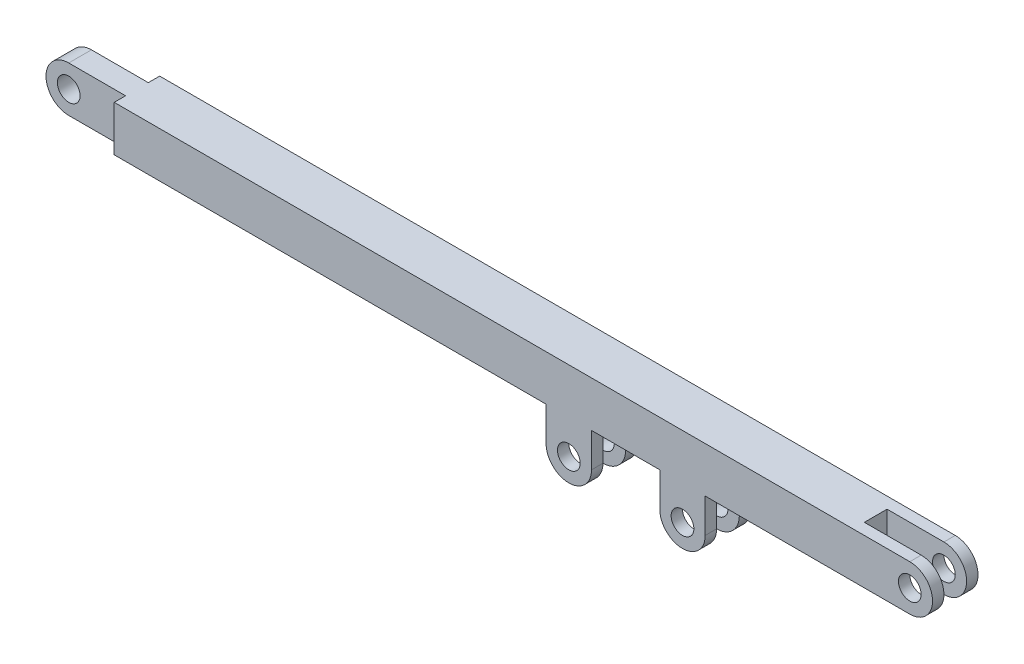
ISO-10303-21;
HEADER;
FILE_DESCRIPTION(('STEP AP214'),'2;1');
FILE_NAME('part.step','',(''),(''),'','','');
FILE_SCHEMA(('AUTOMOTIVE_DESIGN { 1 0 10303 214 1 1 1 1 }'));
ENDSEC;
DATA;
#1=APPLICATION_CONTEXT('core data for automotive mechanical design processes');
#2=APPLICATION_PROTOCOL_DEFINITION('international standard','automotive_design',2000,#1);
#3=PRODUCT_CONTEXT('',#1,'mechanical');
#4=PRODUCT('Part','Part','',(#3));
#5=PRODUCT_RELATED_PRODUCT_CATEGORY('part','',(#4));
#6=PRODUCT_DEFINITION_FORMATION('','',#4);
#7=PRODUCT_DEFINITION_CONTEXT('part definition',#1,'design');
#8=PRODUCT_DEFINITION('design','',#6,#7);
#9=PRODUCT_DEFINITION_SHAPE('','',#8);
#10=(LENGTH_UNIT() NAMED_UNIT(*) SI_UNIT(.MILLI.,.METRE.));
#11=(NAMED_UNIT(*) PLANE_ANGLE_UNIT() SI_UNIT($,.RADIAN.));
#12=(NAMED_UNIT(*) SI_UNIT($,.STERADIAN.) SOLID_ANGLE_UNIT());
#13=UNCERTAINTY_MEASURE_WITH_UNIT(LENGTH_MEASURE(1.E-05),#10,'distance_accuracy_value','');
#14=(GEOMETRIC_REPRESENTATION_CONTEXT(3) GLOBAL_UNCERTAINTY_ASSIGNED_CONTEXT((#13)) GLOBAL_UNIT_ASSIGNED_CONTEXT((#10,
#11,#12)) REPRESENTATION_CONTEXT('',''));
#15=CARTESIAN_POINT('',(0.,0.,0.));
#16=DIRECTION('',(0.,0.,1.));
#17=DIRECTION('',(1.,0.,0.));
#18=AXIS2_PLACEMENT_3D('',#15,#16,#17);
#19=CARTESIAN_POINT('',(860.,-100.,40.));
#20=DIRECTION('',(1.,0.,0.));
#21=DIRECTION('',(0.,0.,-1.));
#22=AXIS2_PLACEMENT_3D('',#19,#20,#21);
#23=PLANE('',#22);
#24=DIRECTION('',(0.,-1.,0.));
#25=VECTOR('',#24,1.);
#26=CARTESIAN_POINT('',(860.,-100.,20.));
#27=LINE('',#26,#25);
#28=CARTESIAN_POINT('',(860.,-40.,20.));
#29=VERTEX_POINT('',#28);
#30=CARTESIAN_POINT('',(860.,-100.,20.));
#31=VERTEX_POINT('',#30);
#32=EDGE_CURVE('E562',#29,#31,#27,.T.);
#33=ORIENTED_EDGE('',*,*,#32,.T.);
#34=DIRECTION('',(0.,0.,-1.));
#35=VECTOR('',#34,1.);
#36=CARTESIAN_POINT('',(860.,-100.,40.));
#37=LINE('',#36,#35);
#38=CARTESIAN_POINT('',(860.,-100.,40.));
#39=VERTEX_POINT('',#38);
#40=EDGE_CURVE('E241',#39,#31,#37,.T.);
#41=ORIENTED_EDGE('',*,*,#40,.F.);
#42=DIRECTION('',(0.,-1.,0.));
#43=VECTOR('',#42,1.);
#44=CARTESIAN_POINT('',(860.,-100.,40.));
#45=LINE('',#44,#43);
#46=CARTESIAN_POINT('',(860.,-40.,40.));
#47=VERTEX_POINT('',#46);
#48=EDGE_CURVE('E546',#47,#39,#45,.T.);
#49=ORIENTED_EDGE('',*,*,#48,.F.);
#50=DIRECTION('',(0.,0.,-1.));
#51=VECTOR('',#50,1.);
#52=CARTESIAN_POINT('',(860.,-40.,40.));
#53=LINE('',#52,#51);
#54=EDGE_CURVE('E545',#47,#29,#53,.T.);
#55=ORIENTED_EDGE('',*,*,#54,.T.);
#56=EDGE_LOOP('',(#33,#41,#49,#55));
#57=FACE_BOUND('',#56,.T.);
#58=ADVANCED_FACE('F32',(#57),#23,.F.);
#59=CARTESIAN_POINT('',(900.,-100.,40.));
#60=DIRECTION('',(0.,0.,-1.));
#61=DIRECTION('',(-1.,0.,0.));
#62=AXIS2_PLACEMENT_3D('',#59,#60,#61);
#63=CYLINDRICAL_SURFACE('',#62,40.);
#64=CARTESIAN_POINT('',(900.,-100.,20.));
#65=DIRECTION('',(0.,0.,1.));
#66=DIRECTION('',(-1.,0.,0.));
#67=AXIS2_PLACEMENT_3D('',#64,#65,#66);
#68=CIRCLE('',#67,40.);
#69=CARTESIAN_POINT('',(940.,-100.,20.));
#70=VERTEX_POINT('',#69);
#71=EDGE_CURVE('E592',#31,#70,#68,.T.);
#72=ORIENTED_EDGE('',*,*,#71,.T.);
#73=DIRECTION('',(0.,0.,-1.));
#74=VECTOR('',#73,1.);
#75=CARTESIAN_POINT('',(940.,-100.,40.));
#76=LINE('',#75,#74);
#77=CARTESIAN_POINT('',(940.,-100.,40.));
#78=VERTEX_POINT('',#77);
#79=EDGE_CURVE('E242',#78,#70,#76,.T.);
#80=ORIENTED_EDGE('',*,*,#79,.F.);
#81=CARTESIAN_POINT('',(900.,-100.,40.));
#82=DIRECTION('',(0.,0.,1.));
#83=DIRECTION('',(-1.,0.,0.));
#84=AXIS2_PLACEMENT_3D('',#81,#82,#83);
#85=CIRCLE('',#84,40.);
#86=EDGE_CURVE('E550',#39,#78,#85,.T.);
#87=ORIENTED_EDGE('',*,*,#86,.F.);
#88=ORIENTED_EDGE('',*,*,#40,.T.);
#89=EDGE_LOOP('',(#72,#80,#87,#88));
#90=FACE_BOUND('',#89,.T.);
#91=ADVANCED_FACE('F493',(#90),#63,.T.);
#92=CARTESIAN_POINT('',(940.,-40.,40.));
#93=DIRECTION('',(-1.,0.,0.));
#94=DIRECTION('',(0.,-1.,0.));
#95=AXIS2_PLACEMENT_3D('',#92,#93,#94);
#96=PLANE('',#95);
#97=DIRECTION('',(0.,1.,0.));
#98=VECTOR('',#97,1.);
#99=CARTESIAN_POINT('',(940.,-40.,20.));
#100=LINE('',#99,#98);
#101=CARTESIAN_POINT('',(940.,-40.,20.));
#102=VERTEX_POINT('',#101);
#103=EDGE_CURVE('E559',#70,#102,#100,.T.);
#104=ORIENTED_EDGE('',*,*,#103,.T.);
#105=DIRECTION('',(0.,0.,-1.));
#106=VECTOR('',#105,1.);
#107=CARTESIAN_POINT('',(940.,-40.,40.));
#108=LINE('',#107,#106);
#109=CARTESIAN_POINT('',(940.,-40.,40.));
#110=VERTEX_POINT('',#109);
#111=EDGE_CURVE('E54',#110,#102,#108,.T.);
#112=ORIENTED_EDGE('',*,*,#111,.F.);
#113=DIRECTION('',(0.,1.,0.));
#114=VECTOR('',#113,1.);
#115=CARTESIAN_POINT('',(940.,-40.,40.));
#116=LINE('',#115,#114);
#117=EDGE_CURVE('E467',#78,#110,#116,.T.);
#118=ORIENTED_EDGE('',*,*,#117,.F.);
#119=ORIENTED_EDGE('',*,*,#79,.T.);
#120=EDGE_LOOP('',(#104,#112,#118,#119));
#121=FACE_BOUND('',#120,.T.);
#122=ADVANCED_FACE('F499',(#121),#96,.F.);
#123=CARTESIAN_POINT('',(900.,-100.,40.));
#124=DIRECTION('',(0.,0.,-1.));
#125=DIRECTION('',(-1.,0.,0.));
#126=AXIS2_PLACEMENT_3D('',#123,#124,#125);
#127=CYLINDRICAL_SURFACE('',#126,20.);
#128=CARTESIAN_POINT('',(900.,-100.,40.));
#129=DIRECTION('',(0.,0.,1.));
#130=DIRECTION('',(1.,0.,0.));
#131=AXIS2_PLACEMENT_3D('',#128,#129,#130);
#132=CIRCLE('',#131,20.);
#133=CARTESIAN_POINT('',(920.,-100.,40.));
#134=VERTEX_POINT('',#133);
#135=EDGE_CURVE('E582',#134,#134,#132,.T.);
#136=ORIENTED_EDGE('',*,*,#135,.T.);
#137=EDGE_LOOP('',(#136));
#138=FACE_BOUND('',#137,.T.);
#139=CARTESIAN_POINT('',(900.,-100.,20.));
#140=DIRECTION('',(0.,0.,1.));
#141=DIRECTION('',(1.,0.,0.));
#142=AXIS2_PLACEMENT_3D('',#139,#140,#141);
#143=CIRCLE('',#142,20.);
#144=CARTESIAN_POINT('',(920.,-100.,20.));
#145=VERTEX_POINT('',#144);
#146=EDGE_CURVE('E599',#145,#145,#143,.T.);
#147=ORIENTED_EDGE('',*,*,#146,.F.);
#148=EDGE_LOOP('',(#147));
#149=FACE_BOUND('',#148,.T.);
#150=ADVANCED_FACE('F618',(#138,#149),#127,.F.);
#151=CARTESIAN_POINT('',(0.,-40.,20.));
#152=DIRECTION('',(0.,1.,0.));
#153=DIRECTION('',(0.,0.,1.));
#154=AXIS2_PLACEMENT_3D('',#151,#152,#153);
#155=PLANE('',#154);
#156=ORIENTED_EDGE('',*,*,#111,.T.);
#157=DIRECTION('',(-1.,0.,0.));
#158=VECTOR('',#157,1.);
#159=CARTESIAN_POINT('',(860.,-40.,20.));
#160=LINE('',#159,#158);
#161=EDGE_CURVE('E47',#102,#29,#160,.T.);
#162=ORIENTED_EDGE('',*,*,#161,.T.);
#163=ORIENTED_EDGE('',*,*,#54,.F.);
#164=DIRECTION('',(1.,0.,0.));
#165=VECTOR('',#164,1.);
#166=CARTESIAN_POINT('',(100.,-40.0000000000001,40.));
#167=LINE('',#166,#165);
#168=CARTESIAN_POINT('',(100.,-40.0000000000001,40.));
#169=VERTEX_POINT('',#168);
#170=EDGE_CURVE('E363',#169,#47,#167,.T.);
#171=ORIENTED_EDGE('',*,*,#170,.F.);
#172=DIRECTION('',(0.,0.,-1.));
#173=VECTOR('',#172,1.);
#174=CARTESIAN_POINT('',(100.,-40.0000000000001,40.));
#175=LINE('',#174,#173);
#176=CARTESIAN_POINT('',(100.,-40.,20.));
#177=VERTEX_POINT('',#176);
#178=EDGE_CURVE('E380',#169,#177,#175,.T.);
#179=ORIENTED_EDGE('',*,*,#178,.T.);
#180=DIRECTION('',(1.,0.,0.));
#181=VECTOR('',#180,1.);
#182=CARTESIAN_POINT('',(0.,-40.,20.));
#183=LINE('',#182,#181);
#184=CARTESIAN_POINT('',(0.,-40.,20.));
#185=VERTEX_POINT('',#184);
#186=EDGE_CURVE('E401',#185,#177,#183,.T.);
#187=ORIENTED_EDGE('',*,*,#186,.F.);
#188=DIRECTION('',(0.,0.,-1.));
#189=VECTOR('',#188,1.);
#190=CARTESIAN_POINT('',(0.,-40.,20.));
#191=LINE('',#190,#189);
#192=CARTESIAN_POINT('',(0.,-40.,-20.));
#193=VERTEX_POINT('',#192);
#194=EDGE_CURVE('E11',#185,#193,#191,.T.);
#195=ORIENTED_EDGE('',*,*,#194,.T.);
#196=DIRECTION('',(1.,0.,0.));
#197=VECTOR('',#196,1.);
#198=CARTESIAN_POINT('',(0.,-40.,-20.));
#199=LINE('',#198,#197);
#200=CARTESIAN_POINT('',(100.,-40.0000000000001,-20.));
#201=VERTEX_POINT('',#200);
#202=EDGE_CURVE('E409',#193,#201,#199,.T.);
#203=ORIENTED_EDGE('',*,*,#202,.T.);
#204=CARTESIAN_POINT('',(100.,-40.0000000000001,-40.));
#205=VERTEX_POINT('',#204);
#206=EDGE_CURVE('E366',#201,#205,#175,.T.);
#207=ORIENTED_EDGE('',*,*,#206,.T.);
#208=DIRECTION('',(1.,0.,0.));
#209=VECTOR('',#208,1.);
#210=CARTESIAN_POINT('',(100.,-40.0000000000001,-40.));
#211=LINE('',#210,#209);
#212=CARTESIAN_POINT('',(860.,-40.,-40.));
#213=VERTEX_POINT('',#212);
#214=EDGE_CURVE('E358',#205,#213,#211,.T.);
#215=ORIENTED_EDGE('',*,*,#214,.T.);
#216=CARTESIAN_POINT('',(860.,-40.,-20.));
#217=VERTEX_POINT('',#216);
#218=EDGE_CURVE('E556',#217,#213,#53,.T.);
#219=ORIENTED_EDGE('',*,*,#218,.F.);
#220=DIRECTION('',(-1.,0.,0.));
#221=VECTOR('',#220,1.);
#222=CARTESIAN_POINT('',(860.,-40.,-20.));
#223=LINE('',#222,#221);
#224=CARTESIAN_POINT('',(940.,-40.,-20.));
#225=VERTEX_POINT('',#224);
#226=EDGE_CURVE('E223',#225,#217,#223,.T.);
#227=ORIENTED_EDGE('',*,*,#226,.F.);
#228=CARTESIAN_POINT('',(940.,-40.,-40.));
#229=VERTEX_POINT('',#228);
#230=EDGE_CURVE('E543',#225,#229,#108,.T.);
#231=ORIENTED_EDGE('',*,*,#230,.T.);
#232=CARTESIAN_POINT('',(1060.,-40.,-40.));
#233=VERTEX_POINT('',#232);
#234=EDGE_CURVE('E379',#229,#233,#211,.T.);
#235=ORIENTED_EDGE('',*,*,#234,.T.);
#236=DIRECTION('',(0.,0.,-1.));
#237=VECTOR('',#236,1.);
#238=CARTESIAN_POINT('',(1060.,-40.,40.));
#239=LINE('',#238,#237);
#240=CARTESIAN_POINT('',(1060.,-40.,-20.));
#241=VERTEX_POINT('',#240);
#242=EDGE_CURVE('E291',#241,#233,#239,.T.);
#243=ORIENTED_EDGE('',*,*,#242,.F.);
#244=DIRECTION('',(-1.,0.,0.));
#245=VECTOR('',#244,1.);
#246=CARTESIAN_POINT('',(1060.,-40.,-20.));
#247=LINE('',#246,#245);
#248=CARTESIAN_POINT('',(1140.,-40.,-20.));
#249=VERTEX_POINT('',#248);
#250=EDGE_CURVE('E263',#249,#241,#247,.T.);
#251=ORIENTED_EDGE('',*,*,#250,.F.);
#252=DIRECTION('',(0.,0.,-1.));
#253=VECTOR('',#252,1.);
#254=CARTESIAN_POINT('',(1140.,-40.,40.));
#255=LINE('',#254,#253);
#256=CARTESIAN_POINT('',(1140.,-40.,-40.));
#257=VERTEX_POINT('',#256);
#258=EDGE_CURVE('E302',#249,#257,#255,.T.);
#259=ORIENTED_EDGE('',*,*,#258,.T.);
#260=CARTESIAN_POINT('',(1500.,-40.,-40.));
#261=VERTEX_POINT('',#260);
#262=EDGE_CURVE('E376',#257,#261,#211,.T.);
#263=ORIENTED_EDGE('',*,*,#262,.T.);
#264=DIRECTION('',(0.,0.,-1.));
#265=VECTOR('',#264,1.);
#266=CARTESIAN_POINT('',(1500.,-40.,20.));
#267=LINE('',#266,#265);
#268=CARTESIAN_POINT('',(1500.,-40.,-20.));
#269=VERTEX_POINT('',#268);
#270=EDGE_CURVE('E418',#269,#261,#267,.T.);
#271=ORIENTED_EDGE('',*,*,#270,.F.);
#272=DIRECTION('',(1.,0.,0.));
#273=VECTOR('',#272,1.);
#274=CARTESIAN_POINT('',(1400.,-40.,-20.));
#275=LINE('',#274,#273);
#276=CARTESIAN_POINT('',(1400.,-40.,-20.));
#277=VERTEX_POINT('',#276);
#278=EDGE_CURVE('E330',#277,#269,#275,.T.);
#279=ORIENTED_EDGE('',*,*,#278,.F.);
#280=DIRECTION('',(0.,0.,1.));
#281=VECTOR('',#280,1.);
#282=CARTESIAN_POINT('',(1400.,-40.,-20.));
#283=LINE('',#282,#281);
#284=CARTESIAN_POINT('',(1400.,-40.,20.));
#285=VERTEX_POINT('',#284);
#286=EDGE_CURVE('E342',#277,#285,#283,.T.);
#287=ORIENTED_EDGE('',*,*,#286,.T.);
#288=DIRECTION('',(1.,0.,0.));
#289=VECTOR('',#288,1.);
#290=CARTESIAN_POINT('',(1400.,-40.,20.));
#291=LINE('',#290,#289);
#292=CARTESIAN_POINT('',(1500.,-40.,20.));
#293=VERTEX_POINT('',#292);
#294=EDGE_CURVE('E324',#285,#293,#291,.T.);
#295=ORIENTED_EDGE('',*,*,#294,.T.);
#296=CARTESIAN_POINT('',(1500.,-40.,40.));
#297=VERTEX_POINT('',#296);
#298=EDGE_CURVE('E40',#297,#293,#267,.T.);
#299=ORIENTED_EDGE('',*,*,#298,.F.);
#300=CARTESIAN_POINT('',(1140.,-40.,40.));
#301=VERTEX_POINT('',#300);
#302=EDGE_CURVE('E362',#301,#297,#167,.T.);
#303=ORIENTED_EDGE('',*,*,#302,.F.);
#304=CARTESIAN_POINT('',(1140.,-40.,20.));
#305=VERTEX_POINT('',#304);
#306=EDGE_CURVE('E303',#301,#305,#255,.T.);
#307=ORIENTED_EDGE('',*,*,#306,.T.);
#308=DIRECTION('',(-1.,0.,0.));
#309=VECTOR('',#308,1.);
#310=CARTESIAN_POINT('',(1060.,-40.,20.));
#311=LINE('',#310,#309);
#312=CARTESIAN_POINT('',(1060.,-40.,20.));
#313=VERTEX_POINT('',#312);
#314=EDGE_CURVE('E259',#305,#313,#311,.T.);
#315=ORIENTED_EDGE('',*,*,#314,.T.);
#316=CARTESIAN_POINT('',(1060.,-40.,40.));
#317=VERTEX_POINT('',#316);
#318=EDGE_CURVE('E299',#317,#313,#239,.T.);
#319=ORIENTED_EDGE('',*,*,#318,.F.);
#320=EDGE_CURVE('E367',#110,#317,#167,.T.);
#321=ORIENTED_EDGE('',*,*,#320,.F.);
#322=EDGE_LOOP('',(#156,#162,#163,#171,#179,#187,#195,#203,#207,#215,#219,#227,#231,#235,#243,
#251,#259,#263,#271,#279,#287,#295,#299,#303,#307,#315,#319,#321));
#323=FACE_BOUND('',#322,.T.);
#324=ADVANCED_FACE('F448',(#323),#155,.F.);
#325=CARTESIAN_POINT('',(1060.,-100.,40.));
#326=DIRECTION('',(1.,0.,0.));
#327=DIRECTION('',(0.,0.,-1.));
#328=AXIS2_PLACEMENT_3D('',#325,#326,#327);
#329=PLANE('',#328);
#330=DIRECTION('',(0.,-1.,0.));
#331=VECTOR('',#330,1.);
#332=CARTESIAN_POINT('',(1060.,-100.,20.));
#333=LINE('',#332,#331);
#334=CARTESIAN_POINT('',(1060.,-100.,20.));
#335=VERTEX_POINT('',#334);
#336=EDGE_CURVE('E253',#313,#335,#333,.T.);
#337=ORIENTED_EDGE('',*,*,#336,.T.);
#338=DIRECTION('',(0.,0.,-1.));
#339=VECTOR('',#338,1.);
#340=CARTESIAN_POINT('',(1060.,-100.,40.));
#341=LINE('',#340,#339);
#342=CARTESIAN_POINT('',(1060.,-100.,40.));
#343=VERTEX_POINT('',#342);
#344=EDGE_CURVE('E311',#343,#335,#341,.T.);
#345=ORIENTED_EDGE('',*,*,#344,.F.);
#346=DIRECTION('',(0.,-1.,0.));
#347=VECTOR('',#346,1.);
#348=CARTESIAN_POINT('',(1060.,-100.,40.));
#349=LINE('',#348,#347);
#350=EDGE_CURVE('E282',#317,#343,#349,.T.);
#351=ORIENTED_EDGE('',*,*,#350,.F.);
#352=ORIENTED_EDGE('',*,*,#318,.T.);
#353=EDGE_LOOP('',(#337,#345,#351,#352));
#354=FACE_BOUND('',#353,.T.);
#355=ADVANCED_FACE('F470',(#354),#329,.F.);
#356=CARTESIAN_POINT('',(1100.,-100.,40.));
#357=DIRECTION('',(0.,0.,-1.));
#358=DIRECTION('',(-1.,0.,0.));
#359=AXIS2_PLACEMENT_3D('',#356,#357,#358);
#360=CYLINDRICAL_SURFACE('',#359,40.);
#361=CARTESIAN_POINT('',(1100.,-100.,20.));
#362=DIRECTION('',(0.,0.,1.));
#363=DIRECTION('',(-1.,0.,0.));
#364=AXIS2_PLACEMENT_3D('',#361,#362,#363);
#365=CIRCLE('',#364,40.);
#366=CARTESIAN_POINT('',(1140.,-100.,20.));
#367=VERTEX_POINT('',#366);
#368=EDGE_CURVE('E268',#335,#367,#365,.T.);
#369=ORIENTED_EDGE('',*,*,#368,.T.);
#370=DIRECTION('',(0.,0.,-1.));
#371=VECTOR('',#370,1.);
#372=CARTESIAN_POINT('',(1140.,-100.,40.));
#373=LINE('',#372,#371);
#374=CARTESIAN_POINT('',(1140.,-100.,40.));
#375=VERTEX_POINT('',#374);
#376=EDGE_CURVE('E307',#375,#367,#373,.T.);
#377=ORIENTED_EDGE('',*,*,#376,.F.);
#378=CARTESIAN_POINT('',(1100.,-100.,40.));
#379=DIRECTION('',(0.,0.,1.));
#380=DIRECTION('',(-1.,0.,0.));
#381=AXIS2_PLACEMENT_3D('',#378,#379,#380);
#382=CIRCLE('',#381,40.);
#383=EDGE_CURVE('E285',#343,#375,#382,.T.);
#384=ORIENTED_EDGE('',*,*,#383,.F.);
#385=ORIENTED_EDGE('',*,*,#344,.T.);
#386=EDGE_LOOP('',(#369,#377,#384,#385));
#387=FACE_BOUND('',#386,.T.);
#388=ADVANCED_FACE('F477',(#387),#360,.T.);
#389=CARTESIAN_POINT('',(1140.,-40.,40.));
#390=DIRECTION('',(-1.,0.,0.));
#391=DIRECTION('',(0.,-1.,0.));
#392=AXIS2_PLACEMENT_3D('',#389,#390,#391);
#393=PLANE('',#392);
#394=DIRECTION('',(0.,1.,0.));
#395=VECTOR('',#394,1.);
#396=CARTESIAN_POINT('',(1140.,-40.,20.));
#397=LINE('',#396,#395);
#398=EDGE_CURVE('E271',#367,#305,#397,.T.);
#399=ORIENTED_EDGE('',*,*,#398,.T.);
#400=ORIENTED_EDGE('',*,*,#306,.F.);
#401=DIRECTION('',(0.,1.,0.));
#402=VECTOR('',#401,1.);
#403=CARTESIAN_POINT('',(1140.,-40.,40.));
#404=LINE('',#403,#402);
#405=EDGE_CURVE('E288',#375,#301,#404,.T.);
#406=ORIENTED_EDGE('',*,*,#405,.F.);
#407=ORIENTED_EDGE('',*,*,#376,.T.);
#408=EDGE_LOOP('',(#399,#400,#406,#407));
#409=FACE_BOUND('',#408,.T.);
#410=ADVANCED_FACE('F474',(#409),#393,.F.);
#411=CARTESIAN_POINT('',(1100.,-100.,40.));
#412=DIRECTION('',(0.,0.,-1.));
#413=DIRECTION('',(-1.,0.,0.));
#414=AXIS2_PLACEMENT_3D('',#411,#412,#413);
#415=CYLINDRICAL_SURFACE('',#414,20.);
#416=CARTESIAN_POINT('',(1100.,-100.,40.));
#417=DIRECTION('',(0.,0.,1.));
#418=DIRECTION('',(1.,0.,0.));
#419=AXIS2_PLACEMENT_3D('',#416,#417,#418);
#420=CIRCLE('',#419,20.);
#421=CARTESIAN_POINT('',(1120.,-100.,40.));
#422=VERTEX_POINT('',#421);
#423=EDGE_CURVE('E276',#422,#422,#420,.T.);
#424=ORIENTED_EDGE('',*,*,#423,.T.);
#425=EDGE_LOOP('',(#424));
#426=FACE_BOUND('',#425,.T.);
#427=CARTESIAN_POINT('',(1100.,-100.,20.));
#428=DIRECTION('',(0.,0.,1.));
#429=DIRECTION('',(1.,0.,0.));
#430=AXIS2_PLACEMENT_3D('',#427,#428,#429);
#431=CIRCLE('',#430,20.);
#432=CARTESIAN_POINT('',(1120.,-100.,20.));
#433=VERTEX_POINT('',#432);
#434=EDGE_CURVE('E245',#433,#433,#431,.T.);
#435=ORIENTED_EDGE('',*,*,#434,.F.);
#436=EDGE_LOOP('',(#435));
#437=FACE_BOUND('',#436,.T.);
#438=ADVANCED_FACE('F485',(#426,#437),#415,.F.);
#439=CARTESIAN_POINT('',(1500.,0.,20.));
#440=DIRECTION('',(0.,0.,-1.));
#441=DIRECTION('',(-1.,0.,0.));
#442=AXIS2_PLACEMENT_3D('',#439,#440,#441);
#443=CYLINDRICAL_SURFACE('',#442,40.);
#444=CARTESIAN_POINT('',(1500.,0.,-20.));
#445=DIRECTION('',(0.,0.,1.));
#446=DIRECTION('',(1.,0.,0.));
#447=AXIS2_PLACEMENT_3D('',#444,#445,#446);
#448=CIRCLE('',#447,40.);
#449=CARTESIAN_POINT('',(1500.,40.,-20.));
#450=VERTEX_POINT('',#449);
#451=EDGE_CURVE('E321',#269,#450,#448,.T.);
#452=ORIENTED_EDGE('',*,*,#451,.F.);
#453=ORIENTED_EDGE('',*,*,#270,.T.);
#454=CARTESIAN_POINT('',(1500.,0.,-40.));
#455=DIRECTION('',(0.,0.,1.));
#456=DIRECTION('',(1.,0.,0.));
#457=AXIS2_PLACEMENT_3D('',#454,#455,#456);
#458=CIRCLE('',#457,40.);
#459=CARTESIAN_POINT('',(1500.,40.,-40.));
#460=VERTEX_POINT('',#459);
#461=EDGE_CURVE('E351',#261,#460,#458,.T.);
#462=ORIENTED_EDGE('',*,*,#461,.T.);
#463=DIRECTION('',(0.,0.,-1.));
#464=VECTOR('',#463,1.);
#465=CARTESIAN_POINT('',(1500.,40.,20.));
#466=LINE('',#465,#464);
#467=EDGE_CURVE('E415',#450,#460,#466,.T.);
#468=ORIENTED_EDGE('',*,*,#467,.F.);
#469=EDGE_LOOP('',(#452,#453,#462,#468));
#470=FACE_BOUND('',#469,.T.);
#471=ADVANCED_FACE('F428',(#470),#443,.T.);
#472=CARTESIAN_POINT('',(0.,40.,20.));
#473=DIRECTION('',(0.,-1.,0.));
#474=DIRECTION('',(0.,0.,-1.));
#475=AXIS2_PLACEMENT_3D('',#472,#473,#474);
#476=PLANE('',#475);
#477=DIRECTION('',(-1.,0.,0.));
#478=VECTOR('',#477,1.);
#479=CARTESIAN_POINT('',(1400.,40.0000000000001,-20.));
#480=LINE('',#479,#478);
#481=CARTESIAN_POINT('',(1400.,40.0000000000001,-20.));
#482=VERTEX_POINT('',#481);
#483=EDGE_CURVE('E323',#450,#482,#480,.T.);
#484=ORIENTED_EDGE('',*,*,#483,.F.);
#485=ORIENTED_EDGE('',*,*,#467,.T.);
#486=DIRECTION('',(-1.,0.,0.));
#487=VECTOR('',#486,1.);
#488=CARTESIAN_POINT('',(100.,40.,-40.));
#489=LINE('',#488,#487);
#490=CARTESIAN_POINT('',(100.,40.,-40.));
#491=VERTEX_POINT('',#490);
#492=EDGE_CURVE('E370',#460,#491,#489,.T.);
#493=ORIENTED_EDGE('',*,*,#492,.T.);
#494=DIRECTION('',(0.,0.,-1.));
#495=VECTOR('',#494,1.);
#496=CARTESIAN_POINT('',(100.,40.,40.));
#497=LINE('',#496,#495);
#498=CARTESIAN_POINT('',(100.,40.,-20.));
#499=VERTEX_POINT('',#498);
#500=EDGE_CURVE('E383',#499,#491,#497,.T.);
#501=ORIENTED_EDGE('',*,*,#500,.F.);
#502=DIRECTION('',(-1.,0.,0.));
#503=VECTOR('',#502,1.);
#504=CARTESIAN_POINT('',(0.,40.,-20.));
#505=LINE('',#504,#503);
#506=CARTESIAN_POINT('',(0.,40.,-20.));
#507=VERTEX_POINT('',#506);
#508=EDGE_CURVE('E402',#499,#507,#505,.T.);
#509=ORIENTED_EDGE('',*,*,#508,.T.);
#510=DIRECTION('',(0.,0.,-1.));
#511=VECTOR('',#510,1.);
#512=CARTESIAN_POINT('',(0.,40.,20.));
#513=LINE('',#512,#511);
#514=CARTESIAN_POINT('',(0.,40.,20.));
#515=VERTEX_POINT('',#514);
#516=EDGE_CURVE('E406',#515,#507,#513,.T.);
#517=ORIENTED_EDGE('',*,*,#516,.F.);
#518=DIRECTION('',(-1.,0.,0.));
#519=VECTOR('',#518,1.);
#520=CARTESIAN_POINT('',(0.,40.,20.));
#521=LINE('',#520,#519);
#522=CARTESIAN_POINT('',(100.,40.,20.));
#523=VERTEX_POINT('',#522);
#524=EDGE_CURVE('E404',#523,#515,#521,.T.);
#525=ORIENTED_EDGE('',*,*,#524,.F.);
#526=CARTESIAN_POINT('',(100.,40.,40.));
#527=VERTEX_POINT('',#526);
#528=EDGE_CURVE('E384',#527,#523,#497,.T.);
#529=ORIENTED_EDGE('',*,*,#528,.F.);
#530=DIRECTION('',(-1.,0.,0.));
#531=VECTOR('',#530,1.);
#532=CARTESIAN_POINT('',(100.,40.,40.));
#533=LINE('',#532,#531);
#534=CARTESIAN_POINT('',(1500.,40.,40.));
#535=VERTEX_POINT('',#534);
#536=EDGE_CURVE('E357',#535,#527,#533,.T.);
#537=ORIENTED_EDGE('',*,*,#536,.F.);
#538=CARTESIAN_POINT('',(1500.,40.,20.));
#539=VERTEX_POINT('',#538);
#540=EDGE_CURVE('E416',#535,#539,#466,.T.);
#541=ORIENTED_EDGE('',*,*,#540,.T.);
#542=DIRECTION('',(-1.,0.,0.));
#543=VECTOR('',#542,1.);
#544=CARTESIAN_POINT('',(1400.,40.0000000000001,20.));
#545=LINE('',#544,#543);
#546=CARTESIAN_POINT('',(1400.,40.,20.));
#547=VERTEX_POINT('',#546);
#548=EDGE_CURVE('E335',#539,#547,#545,.T.);
#549=ORIENTED_EDGE('',*,*,#548,.T.);
#550=DIRECTION('',(0.,0.,1.));
#551=VECTOR('',#550,1.);
#552=CARTESIAN_POINT('',(1400.,40.0000000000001,-20.));
#553=LINE('',#552,#551);
#554=EDGE_CURVE('E332',#482,#547,#553,.T.);
#555=ORIENTED_EDGE('',*,*,#554,.F.);
#556=EDGE_LOOP('',(#484,#485,#493,#501,#509,#517,#525,#529,#537,#541,#549,#555));
#557=FACE_BOUND('',#556,.T.);
#558=ADVANCED_FACE('F443',(#557),#476,.F.);
#559=CARTESIAN_POINT('',(1500.,0.,20.));
#560=DIRECTION('',(0.,0.,-1.));
#561=DIRECTION('',(-1.,0.,0.));
#562=AXIS2_PLACEMENT_3D('',#559,#560,#561);
#563=CYLINDRICAL_SURFACE('',#562,20.);
#564=CARTESIAN_POINT('',(1500.,0.,-40.));
#565=DIRECTION('',(0.,0.,1.));
#566=DIRECTION('',(1.,0.,0.));
#567=AXIS2_PLACEMENT_3D('',#564,#565,#566);
#568=CIRCLE('',#567,20.);
#569=CARTESIAN_POINT('',(1520.,0.,-40.));
#570=VERTEX_POINT('',#569);
#571=EDGE_CURVE('E345',#570,#570,#568,.T.);
#572=ORIENTED_EDGE('',*,*,#571,.F.);
#573=EDGE_LOOP('',(#572));
#574=FACE_BOUND('',#573,.T.);
#575=CARTESIAN_POINT('',(1500.,0.,-20.));
#576=DIRECTION('',(0.,0.,1.));
#577=DIRECTION('',(1.,0.,0.));
#578=AXIS2_PLACEMENT_3D('',#575,#576,#577);
#579=CIRCLE('',#578,20.);
#580=CARTESIAN_POINT('',(1520.,0.,-20.));
#581=VERTEX_POINT('',#580);
#582=EDGE_CURVE('E315',#581,#581,#579,.T.);
#583=ORIENTED_EDGE('',*,*,#582,.T.);
#584=EDGE_LOOP('',(#583));
#585=FACE_BOUND('',#584,.T.);
#586=ADVANCED_FACE('F640',(#574,#585),#563,.F.);
#587=CARTESIAN_POINT('',(0.,0.,20.));
#588=DIRECTION('',(0.,0.,1.));
#589=DIRECTION('',(1.,0.,0.));
#590=AXIS2_PLACEMENT_3D('',#587,#588,#589);
#591=PLANE('',#590);
#592=CARTESIAN_POINT('',(0.,0.,20.));
#593=DIRECTION('',(0.,0.,1.));
#594=DIRECTION('',(1.,0.,0.));
#595=AXIS2_PLACEMENT_3D('',#592,#593,#594);
#596=CIRCLE('',#595,20.);
#597=CARTESIAN_POINT('',(20.,0.,20.));
#598=VERTEX_POINT('',#597);
#599=EDGE_CURVE('E392',#598,#598,#596,.T.);
#600=ORIENTED_EDGE('',*,*,#599,.F.);
#601=EDGE_LOOP('',(#600));
#602=FACE_BOUND('',#601,.T.);
#603=ORIENTED_EDGE('',*,*,#186,.T.);
#604=DIRECTION('',(0.,1.,0.));
#605=VECTOR('',#604,1.);
#606=CARTESIAN_POINT('',(100.,0.,20.));
#607=LINE('',#606,#605);
#608=EDGE_CURVE('E389',#177,#523,#607,.T.);
#609=ORIENTED_EDGE('',*,*,#608,.T.);
#610=ORIENTED_EDGE('',*,*,#524,.T.);
#611=CARTESIAN_POINT('',(0.,0.,20.));
#612=DIRECTION('',(0.,0.,1.));
#613=DIRECTION('',(1.,0.,0.));
#614=AXIS2_PLACEMENT_3D('',#611,#612,#613);
#615=CIRCLE('',#614,40.);
#616=EDGE_CURVE('E398',#515,#185,#615,.T.);
#617=ORIENTED_EDGE('',*,*,#616,.T.);
#618=EDGE_LOOP('',(#603,#609,#610,#617));
#619=FACE_BOUND('',#618,.T.);
#620=ADVANCED_FACE('F569',(#602,#619),#591,.T.);
#621=CARTESIAN_POINT('',(0.,0.,-20.));
#622=DIRECTION('',(0.,0.,1.));
#623=DIRECTION('',(1.,0.,0.));
#624=AXIS2_PLACEMENT_3D('',#621,#622,#623);
#625=PLANE('',#624);
#626=CARTESIAN_POINT('',(0.,0.,-20.));
#627=DIRECTION('',(0.,0.,1.));
#628=DIRECTION('',(1.,0.,0.));
#629=AXIS2_PLACEMENT_3D('',#626,#627,#628);
#630=CIRCLE('',#629,20.);
#631=CARTESIAN_POINT('',(20.,0.,-20.));
#632=VERTEX_POINT('',#631);
#633=EDGE_CURVE('E391',#632,#632,#630,.T.);
#634=ORIENTED_EDGE('',*,*,#633,.T.);
#635=EDGE_LOOP('',(#634));
#636=FACE_BOUND('',#635,.T.);
#637=DIRECTION('',(0.,1.,0.));
#638=VECTOR('',#637,1.);
#639=CARTESIAN_POINT('',(100.,0.,-20.));
#640=LINE('',#639,#638);
#641=EDGE_CURVE('E387',#201,#499,#640,.T.);
#642=ORIENTED_EDGE('',*,*,#641,.F.);
#643=ORIENTED_EDGE('',*,*,#202,.F.);
#644=CARTESIAN_POINT('',(0.,0.,-20.));
#645=DIRECTION('',(0.,0.,1.));
#646=DIRECTION('',(1.,0.,0.));
#647=AXIS2_PLACEMENT_3D('',#644,#645,#646);
#648=CIRCLE('',#647,40.);
#649=EDGE_CURVE('E395',#507,#193,#648,.T.);
#650=ORIENTED_EDGE('',*,*,#649,.F.);
#651=ORIENTED_EDGE('',*,*,#508,.F.);
#652=EDGE_LOOP('',(#642,#643,#650,#651));
#653=FACE_BOUND('',#652,.T.);
#654=ADVANCED_FACE('F577',(#636,#653),#625,.F.);
#655=CARTESIAN_POINT('',(0.,0.,20.));
#656=DIRECTION('',(0.,0.,-1.));
#657=DIRECTION('',(-1.,0.,0.));
#658=AXIS2_PLACEMENT_3D('',#655,#656,#657);
#659=CYLINDRICAL_SURFACE('',#658,40.);
#660=ORIENTED_EDGE('',*,*,#649,.T.);
#661=ORIENTED_EDGE('',*,*,#194,.F.);
#662=ORIENTED_EDGE('',*,*,#616,.F.);
#663=ORIENTED_EDGE('',*,*,#516,.T.);
#664=EDGE_LOOP('',(#660,#661,#662,#663));
#665=FACE_BOUND('',#664,.T.);
#666=ADVANCED_FACE('F34',(#665),#659,.T.);
#667=ORIENTED_EDGE('',*,*,#298,.T.);
#668=CARTESIAN_POINT('',(1500.,0.,20.));
#669=DIRECTION('',(0.,0.,1.));
#670=DIRECTION('',(1.,0.,0.));
#671=AXIS2_PLACEMENT_3D('',#668,#669,#670);
#672=CIRCLE('',#671,40.);
#673=EDGE_CURVE('E318',#293,#539,#672,.T.);
#674=ORIENTED_EDGE('',*,*,#673,.T.);
#675=ORIENTED_EDGE('',*,*,#540,.F.);
#676=CARTESIAN_POINT('',(1500.,0.,40.));
#677=DIRECTION('',(0.,0.,1.));
#678=DIRECTION('',(1.,0.,0.));
#679=AXIS2_PLACEMENT_3D('',#676,#677,#678);
#680=CIRCLE('',#679,40.);
#681=EDGE_CURVE('E354',#297,#535,#680,.T.);
#682=ORIENTED_EDGE('',*,*,#681,.F.);
#683=EDGE_LOOP('',(#667,#674,#675,#682));
#684=FACE_BOUND('',#683,.T.);
#685=ADVANCED_FACE('F454',(#684),#443,.T.);
#686=CARTESIAN_POINT('',(0.,0.,20.));
#687=DIRECTION('',(0.,0.,-1.));
#688=DIRECTION('',(-1.,0.,0.));
#689=AXIS2_PLACEMENT_3D('',#686,#687,#688);
#690=CYLINDRICAL_SURFACE('',#689,20.);
#691=ORIENTED_EDGE('',*,*,#599,.T.);
#692=EDGE_LOOP('',(#691));
#693=FACE_BOUND('',#692,.T.);
#694=ORIENTED_EDGE('',*,*,#633,.F.);
#695=EDGE_LOOP('',(#694));
#696=FACE_BOUND('',#695,.T.);
#697=ADVANCED_FACE('F637',(#693,#696),#690,.F.);
#698=CARTESIAN_POINT('',(100.,40.,40.));
#699=DIRECTION('',(1.,0.,0.));
#700=DIRECTION('',(0.,1.,0.));
#701=AXIS2_PLACEMENT_3D('',#698,#699,#700);
#702=PLANE('',#701);
#703=ORIENTED_EDGE('',*,*,#206,.F.);
#704=ORIENTED_EDGE('',*,*,#641,.T.);
#705=ORIENTED_EDGE('',*,*,#500,.T.);
#706=DIRECTION('',(0.,-1.,0.));
#707=VECTOR('',#706,1.);
#708=CARTESIAN_POINT('',(100.,40.,-40.));
#709=LINE('',#708,#707);
#710=EDGE_CURVE('E373',#491,#205,#709,.T.);
#711=ORIENTED_EDGE('',*,*,#710,.T.);
#712=EDGE_LOOP('',(#703,#704,#705,#711));
#713=FACE_BOUND('',#712,.T.);
#714=ADVANCED_FACE('F579',(#713),#702,.F.);
#715=CARTESIAN_POINT('',(1500.,0.,-40.));
#716=DIRECTION('',(0.,0.,1.));
#717=DIRECTION('',(1.,0.,0.));
#718=AXIS2_PLACEMENT_3D('',#715,#716,#717);
#719=PLANE('',#718);
#720=ORIENTED_EDGE('',*,*,#461,.F.);
#721=ORIENTED_EDGE('',*,*,#262,.F.);
#722=DIRECTION('',(0.,1.,0.));
#723=VECTOR('',#722,1.);
#724=CARTESIAN_POINT('',(1140.,-40.,-40.));
#725=LINE('',#724,#723);
#726=CARTESIAN_POINT('',(1140.,-100.,-40.));
#727=VERTEX_POINT('',#726);
#728=EDGE_CURVE('E286',#727,#257,#725,.T.);
#729=ORIENTED_EDGE('',*,*,#728,.F.);
#730=CARTESIAN_POINT('',(1100.,-100.,-40.));
#731=DIRECTION('',(0.,0.,1.));
#732=DIRECTION('',(-1.,0.,0.));
#733=AXIS2_PLACEMENT_3D('',#730,#731,#732);
#734=CIRCLE('',#733,40.);
#735=CARTESIAN_POINT('',(1060.,-100.,-40.));
#736=VERTEX_POINT('',#735);
#737=EDGE_CURVE('E294',#736,#727,#734,.T.);
#738=ORIENTED_EDGE('',*,*,#737,.F.);
#739=DIRECTION('',(0.,-1.,0.));
#740=VECTOR('',#739,1.);
#741=CARTESIAN_POINT('',(1060.,-100.,-40.));
#742=LINE('',#741,#740);
#743=EDGE_CURVE('E279',#233,#736,#742,.T.);
#744=ORIENTED_EDGE('',*,*,#743,.F.);
#745=ORIENTED_EDGE('',*,*,#234,.F.);
#746=DIRECTION('',(0.,1.,0.));
#747=VECTOR('',#746,1.);
#748=CARTESIAN_POINT('',(940.,-40.,-40.));
#749=LINE('',#748,#747);
#750=CARTESIAN_POINT('',(940.,-100.,-40.));
#751=VERTEX_POINT('',#750);
#752=EDGE_CURVE('E541',#751,#229,#749,.T.);
#753=ORIENTED_EDGE('',*,*,#752,.F.);
#754=CARTESIAN_POINT('',(900.,-100.,-40.));
#755=DIRECTION('',(0.,0.,1.));
#756=DIRECTION('',(-1.,0.,0.));
#757=AXIS2_PLACEMENT_3D('',#754,#755,#756);
#758=CIRCLE('',#757,40.);
#759=CARTESIAN_POINT('',(860.,-100.,-40.));
#760=VERTEX_POINT('',#759);
#761=EDGE_CURVE('E547',#760,#751,#758,.T.);
#762=ORIENTED_EDGE('',*,*,#761,.F.);
#763=DIRECTION('',(0.,-1.,0.));
#764=VECTOR('',#763,1.);
#765=CARTESIAN_POINT('',(860.,-100.,-40.));
#766=LINE('',#765,#764);
#767=EDGE_CURVE('E240',#213,#760,#766,.T.);
#768=ORIENTED_EDGE('',*,*,#767,.F.);
#769=ORIENTED_EDGE('',*,*,#214,.F.);
#770=ORIENTED_EDGE('',*,*,#710,.F.);
#771=ORIENTED_EDGE('',*,*,#492,.F.);
#772=EDGE_LOOP('',(#720,#721,#729,#738,#744,#745,#753,#762,#768,#769,#770,#771));
#773=FACE_BOUND('',#772,.T.);
#774=ORIENTED_EDGE('',*,*,#571,.T.);
#775=EDGE_LOOP('',(#774));
#776=FACE_BOUND('',#775,.T.);
#777=CARTESIAN_POINT('',(1100.,-100.,-40.));
#778=DIRECTION('',(0.,0.,1.));
#779=DIRECTION('',(1.,0.,0.));
#780=AXIS2_PLACEMENT_3D('',#777,#778,#779);
#781=CIRCLE('',#780,20.);
#782=CARTESIAN_POINT('',(1120.,-100.,-40.));
#783=VERTEX_POINT('',#782);
#784=EDGE_CURVE('E265',#783,#783,#781,.T.);
#785=ORIENTED_EDGE('',*,*,#784,.T.);
#786=EDGE_LOOP('',(#785));
#787=FACE_BOUND('',#786,.T.);
#788=CARTESIAN_POINT('',(900.,-100.,-40.));
#789=DIRECTION('',(0.,0.,1.));
#790=DIRECTION('',(1.,0.,0.));
#791=AXIS2_PLACEMENT_3D('',#788,#789,#790);
#792=CIRCLE('',#791,20.);
#793=CARTESIAN_POINT('',(920.,-100.,-40.));
#794=VERTEX_POINT('',#793);
#795=EDGE_CURVE('E584',#794,#794,#792,.T.);
#796=ORIENTED_EDGE('',*,*,#795,.T.);
#797=EDGE_LOOP('',(#796));
#798=FACE_BOUND('',#797,.T.);
#799=ADVANCED_FACE('F435',(#773,#776,#787,#798),#719,.F.);
#800=CARTESIAN_POINT('',(1500.,0.,20.));
#801=DIRECTION('',(0.,0.,1.));
#802=DIRECTION('',(1.,0.,0.));
#803=AXIS2_PLACEMENT_3D('',#800,#801,#802);
#804=CIRCLE('',#803,20.);
#805=CARTESIAN_POINT('',(1520.,0.,20.));
#806=VERTEX_POINT('',#805);
#807=EDGE_CURVE('E314',#806,#806,#804,.T.);
#808=ORIENTED_EDGE('',*,*,#807,.F.);
#809=EDGE_LOOP('',(#808));
#810=FACE_BOUND('',#809,.T.);
#811=CARTESIAN_POINT('',(1500.,0.,40.));
#812=DIRECTION('',(0.,0.,1.));
#813=DIRECTION('',(1.,0.,0.));
#814=AXIS2_PLACEMENT_3D('',#811,#812,#813);
#815=CIRCLE('',#814,20.);
#816=CARTESIAN_POINT('',(1520.,0.,40.));
#817=VERTEX_POINT('',#816);
#818=EDGE_CURVE('E348',#817,#817,#815,.T.);
#819=ORIENTED_EDGE('',*,*,#818,.T.);
#820=EDGE_LOOP('',(#819));
#821=FACE_BOUND('',#820,.T.);
#822=ADVANCED_FACE('F650',(#810,#821),#563,.F.);
#823=CARTESIAN_POINT('',(1500.,0.,40.));
#824=DIRECTION('',(0.,0.,1.));
#825=DIRECTION('',(1.,0.,0.));
#826=AXIS2_PLACEMENT_3D('',#823,#824,#825);
#827=PLANE('',#826);
#828=ORIENTED_EDGE('',*,*,#681,.T.);
#829=ORIENTED_EDGE('',*,*,#536,.T.);
#830=DIRECTION('',(0.,-1.,0.));
#831=VECTOR('',#830,1.);
#832=CARTESIAN_POINT('',(100.,40.,40.));
#833=LINE('',#832,#831);
#834=EDGE_CURVE('E360',#527,#169,#833,.T.);
#835=ORIENTED_EDGE('',*,*,#834,.T.);
#836=ORIENTED_EDGE('',*,*,#170,.T.);
#837=ORIENTED_EDGE('',*,*,#48,.T.);
#838=ORIENTED_EDGE('',*,*,#86,.T.);
#839=ORIENTED_EDGE('',*,*,#117,.T.);
#840=ORIENTED_EDGE('',*,*,#320,.T.);
#841=ORIENTED_EDGE('',*,*,#350,.T.);
#842=ORIENTED_EDGE('',*,*,#383,.T.);
#843=ORIENTED_EDGE('',*,*,#405,.T.);
#844=ORIENTED_EDGE('',*,*,#302,.T.);
#845=EDGE_LOOP('',(#828,#829,#835,#836,#837,#838,#839,#840,#841,#842,#843,#844));
#846=FACE_BOUND('',#845,.T.);
#847=ORIENTED_EDGE('',*,*,#818,.F.);
#848=EDGE_LOOP('',(#847));
#849=FACE_BOUND('',#848,.T.);
#850=ORIENTED_EDGE('',*,*,#423,.F.);
#851=EDGE_LOOP('',(#850));
#852=FACE_BOUND('',#851,.T.);
#853=ORIENTED_EDGE('',*,*,#135,.F.);
#854=EDGE_LOOP('',(#853));
#855=FACE_BOUND('',#854,.T.);
#856=ADVANCED_FACE('F460',(#846,#849,#852,#855),#827,.T.);
#857=ORIENTED_EDGE('',*,*,#608,.F.);
#858=ORIENTED_EDGE('',*,*,#178,.F.);
#859=ORIENTED_EDGE('',*,*,#834,.F.);
#860=ORIENTED_EDGE('',*,*,#528,.T.);
#861=EDGE_LOOP('',(#857,#858,#859,#860));
#862=FACE_BOUND('',#861,.T.);
#863=ADVANCED_FACE('F567',(#862),#702,.F.);
#864=CARTESIAN_POINT('',(1400.,40.0000000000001,-20.));
#865=DIRECTION('',(-1.,0.,0.));
#866=DIRECTION('',(0.,0.,1.));
#867=AXIS2_PLACEMENT_3D('',#864,#865,#866);
#868=PLANE('',#867);
#869=DIRECTION('',(0.,-1.,0.));
#870=VECTOR('',#869,1.);
#871=CARTESIAN_POINT('',(1400.,40.0000000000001,20.));
#872=LINE('',#871,#870);
#873=EDGE_CURVE('E338',#547,#285,#872,.T.);
#874=ORIENTED_EDGE('',*,*,#873,.T.);
#875=ORIENTED_EDGE('',*,*,#286,.F.);
#876=DIRECTION('',(0.,-1.,0.));
#877=VECTOR('',#876,1.);
#878=CARTESIAN_POINT('',(1400.,40.0000000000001,-20.));
#879=LINE('',#878,#877);
#880=EDGE_CURVE('E327',#482,#277,#879,.T.);
#881=ORIENTED_EDGE('',*,*,#880,.F.);
#882=ORIENTED_EDGE('',*,*,#554,.T.);
#883=EDGE_LOOP('',(#874,#875,#881,#882));
#884=FACE_BOUND('',#883,.T.);
#885=ADVANCED_FACE('F451',(#884),#868,.F.);
#886=CARTESIAN_POINT('',(1500.,0.,-20.));
#887=DIRECTION('',(0.,0.,1.));
#888=DIRECTION('',(1.,0.,0.));
#889=AXIS2_PLACEMENT_3D('',#886,#887,#888);
#890=PLANE('',#889);
#891=ORIENTED_EDGE('',*,*,#582,.F.);
#892=EDGE_LOOP('',(#891));
#893=FACE_BOUND('',#892,.T.);
#894=ORIENTED_EDGE('',*,*,#451,.T.);
#895=ORIENTED_EDGE('',*,*,#483,.T.);
#896=ORIENTED_EDGE('',*,*,#880,.T.);
#897=ORIENTED_EDGE('',*,*,#278,.T.);
#898=EDGE_LOOP('',(#894,#895,#896,#897));
#899=FACE_BOUND('',#898,.T.);
#900=ADVANCED_FACE('F447',(#893,#899),#890,.T.);
#901=CARTESIAN_POINT('',(1500.,0.,20.));
#902=DIRECTION('',(0.,0.,1.));
#903=DIRECTION('',(1.,0.,0.));
#904=AXIS2_PLACEMENT_3D('',#901,#902,#903);
#905=PLANE('',#904);
#906=ORIENTED_EDGE('',*,*,#807,.T.);
#907=EDGE_LOOP('',(#906));
#908=FACE_BOUND('',#907,.T.);
#909=ORIENTED_EDGE('',*,*,#673,.F.);
#910=ORIENTED_EDGE('',*,*,#294,.F.);
#911=ORIENTED_EDGE('',*,*,#873,.F.);
#912=ORIENTED_EDGE('',*,*,#548,.F.);
#913=EDGE_LOOP('',(#909,#910,#911,#912));
#914=FACE_BOUND('',#913,.T.);
#915=ADVANCED_FACE('F453',(#908,#914),#905,.F.);
#916=CARTESIAN_POINT('',(1060.,-100.,-20.));
#917=VERTEX_POINT('',#916);
#918=EDGE_CURVE('E310',#917,#736,#341,.T.);
#919=ORIENTED_EDGE('',*,*,#918,.F.);
#920=DIRECTION('',(0.,-1.,0.));
#921=VECTOR('',#920,1.);
#922=CARTESIAN_POINT('',(1060.,-100.,-20.));
#923=LINE('',#922,#921);
#924=EDGE_CURVE('E256',#241,#917,#923,.T.);
#925=ORIENTED_EDGE('',*,*,#924,.F.);
#926=ORIENTED_EDGE('',*,*,#242,.T.);
#927=ORIENTED_EDGE('',*,*,#743,.T.);
#928=EDGE_LOOP('',(#919,#925,#926,#927));
#929=FACE_BOUND('',#928,.T.);
#930=ADVANCED_FACE('F489',(#929),#329,.F.);
#931=CARTESIAN_POINT('',(1140.,-100.,-20.));
#932=VERTEX_POINT('',#931);
#933=EDGE_CURVE('E306',#932,#727,#373,.T.);
#934=ORIENTED_EDGE('',*,*,#933,.F.);
#935=CARTESIAN_POINT('',(1100.,-100.,-20.));
#936=DIRECTION('',(0.,0.,1.));
#937=DIRECTION('',(-1.,0.,0.));
#938=AXIS2_PLACEMENT_3D('',#935,#936,#937);
#939=CIRCLE('',#938,40.);
#940=EDGE_CURVE('E258',#917,#932,#939,.T.);
#941=ORIENTED_EDGE('',*,*,#940,.F.);
#942=ORIENTED_EDGE('',*,*,#918,.T.);
#943=ORIENTED_EDGE('',*,*,#737,.T.);
#944=EDGE_LOOP('',(#934,#941,#942,#943));
#945=FACE_BOUND('',#944,.T.);
#946=ADVANCED_FACE('F480',(#945),#360,.T.);
#947=ORIENTED_EDGE('',*,*,#258,.F.);
#948=DIRECTION('',(0.,1.,0.));
#949=VECTOR('',#948,1.);
#950=CARTESIAN_POINT('',(1140.,-40.,-20.));
#951=LINE('',#950,#949);
#952=EDGE_CURVE('E261',#932,#249,#951,.T.);
#953=ORIENTED_EDGE('',*,*,#952,.F.);
#954=ORIENTED_EDGE('',*,*,#933,.T.);
#955=ORIENTED_EDGE('',*,*,#728,.T.);
#956=EDGE_LOOP('',(#947,#953,#954,#955));
#957=FACE_BOUND('',#956,.T.);
#958=ADVANCED_FACE('F487',(#957),#393,.F.);
#959=CARTESIAN_POINT('',(1100.,-100.,-20.));
#960=DIRECTION('',(0.,0.,1.));
#961=DIRECTION('',(1.,0.,0.));
#962=AXIS2_PLACEMENT_3D('',#959,#960,#961);
#963=CIRCLE('',#962,20.);
#964=CARTESIAN_POINT('',(1120.,-100.,-20.));
#965=VERTEX_POINT('',#964);
#966=EDGE_CURVE('E250',#965,#965,#963,.T.);
#967=ORIENTED_EDGE('',*,*,#966,.T.);
#968=EDGE_LOOP('',(#967));
#969=FACE_BOUND('',#968,.T.);
#970=ORIENTED_EDGE('',*,*,#784,.F.);
#971=EDGE_LOOP('',(#970));
#972=FACE_BOUND('',#971,.T.);
#973=ADVANCED_FACE('F516',(#969,#972),#415,.F.);
#974=CARTESIAN_POINT('',(1100.,-100.,-20.));
#975=DIRECTION('',(0.,0.,-1.));
#976=DIRECTION('',(-1.,0.,0.));
#977=AXIS2_PLACEMENT_3D('',#974,#975,#976);
#978=PLANE('',#977);
#979=ORIENTED_EDGE('',*,*,#966,.F.);
#980=EDGE_LOOP('',(#979));
#981=FACE_BOUND('',#980,.T.);
#982=ORIENTED_EDGE('',*,*,#924,.T.);
#983=ORIENTED_EDGE('',*,*,#940,.T.);
#984=ORIENTED_EDGE('',*,*,#952,.T.);
#985=ORIENTED_EDGE('',*,*,#250,.T.);
#986=EDGE_LOOP('',(#982,#983,#984,#985));
#987=FACE_BOUND('',#986,.T.);
#988=ADVANCED_FACE('F510',(#981,#987),#978,.F.);
#989=CARTESIAN_POINT('',(1100.,-100.,20.));
#990=DIRECTION('',(0.,0.,-1.));
#991=DIRECTION('',(-1.,0.,0.));
#992=AXIS2_PLACEMENT_3D('',#989,#990,#991);
#993=PLANE('',#992);
#994=ORIENTED_EDGE('',*,*,#434,.T.);
#995=EDGE_LOOP('',(#994));
#996=FACE_BOUND('',#995,.T.);
#997=ORIENTED_EDGE('',*,*,#336,.F.);
#998=ORIENTED_EDGE('',*,*,#314,.F.);
#999=ORIENTED_EDGE('',*,*,#398,.F.);
#1000=ORIENTED_EDGE('',*,*,#368,.F.);
#1001=EDGE_LOOP('',(#997,#998,#999,#1000));
#1002=FACE_BOUND('',#1001,.T.);
#1003=ADVANCED_FACE('F472',(#996,#1002),#993,.T.);
#1004=CARTESIAN_POINT('',(860.,-100.,-20.));
#1005=VERTEX_POINT('',#1004);
#1006=EDGE_CURVE('E232',#1005,#760,#37,.T.);
#1007=ORIENTED_EDGE('',*,*,#1006,.F.);
#1008=DIRECTION('',(0.,-1.,0.));
#1009=VECTOR('',#1008,1.);
#1010=CARTESIAN_POINT('',(860.,-100.,-20.));
#1011=LINE('',#1010,#1009);
#1012=EDGE_CURVE('E217',#217,#1005,#1011,.T.);
#1013=ORIENTED_EDGE('',*,*,#1012,.F.);
#1014=ORIENTED_EDGE('',*,*,#218,.T.);
#1015=ORIENTED_EDGE('',*,*,#767,.T.);
#1016=EDGE_LOOP('',(#1007,#1013,#1014,#1015));
#1017=FACE_BOUND('',#1016,.T.);
#1018=ADVANCED_FACE('F238',(#1017),#23,.F.);
#1019=CARTESIAN_POINT('',(940.,-100.,-20.));
#1020=VERTEX_POINT('',#1019);
#1021=EDGE_CURVE('E234',#1020,#751,#76,.T.);
#1022=ORIENTED_EDGE('',*,*,#1021,.F.);
#1023=CARTESIAN_POINT('',(900.,-100.,-20.));
#1024=DIRECTION('',(0.,0.,1.));
#1025=DIRECTION('',(-1.,0.,0.));
#1026=AXIS2_PLACEMENT_3D('',#1023,#1024,#1025);
#1027=CIRCLE('',#1026,40.);
#1028=EDGE_CURVE('E220',#1005,#1020,#1027,.T.);
#1029=ORIENTED_EDGE('',*,*,#1028,.F.);
#1030=ORIENTED_EDGE('',*,*,#1006,.T.);
#1031=ORIENTED_EDGE('',*,*,#761,.T.);
#1032=EDGE_LOOP('',(#1022,#1029,#1030,#1031));
#1033=FACE_BOUND('',#1032,.T.);
#1034=ADVANCED_FACE('F230',(#1033),#63,.T.);
#1035=ORIENTED_EDGE('',*,*,#230,.F.);
#1036=DIRECTION('',(0.,1.,0.));
#1037=VECTOR('',#1036,1.);
#1038=CARTESIAN_POINT('',(940.,-40.,-20.));
#1039=LINE('',#1038,#1037);
#1040=EDGE_CURVE('E235',#1020,#225,#1039,.T.);
#1041=ORIENTED_EDGE('',*,*,#1040,.F.);
#1042=ORIENTED_EDGE('',*,*,#1021,.T.);
#1043=ORIENTED_EDGE('',*,*,#752,.T.);
#1044=EDGE_LOOP('',(#1035,#1041,#1042,#1043));
#1045=FACE_BOUND('',#1044,.T.);
#1046=ADVANCED_FACE('F509',(#1045),#96,.F.);
#1047=CARTESIAN_POINT('',(900.,-100.,-20.));
#1048=DIRECTION('',(0.,0.,1.));
#1049=DIRECTION('',(1.,0.,0.));
#1050=AXIS2_PLACEMENT_3D('',#1047,#1048,#1049);
#1051=CIRCLE('',#1050,20.);
#1052=CARTESIAN_POINT('',(920.,-100.,-20.));
#1053=VERTEX_POINT('',#1052);
#1054=EDGE_CURVE('E596',#1053,#1053,#1051,.T.);
#1055=ORIENTED_EDGE('',*,*,#1054,.T.);
#1056=EDGE_LOOP('',(#1055));
#1057=FACE_BOUND('',#1056,.T.);
#1058=ORIENTED_EDGE('',*,*,#795,.F.);
#1059=EDGE_LOOP('',(#1058));
#1060=FACE_BOUND('',#1059,.T.);
#1061=ADVANCED_FACE('F605',(#1057,#1060),#127,.F.);
#1062=CARTESIAN_POINT('',(900.,-100.,-20.));
#1063=DIRECTION('',(0.,0.,-1.));
#1064=DIRECTION('',(-1.,0.,0.));
#1065=AXIS2_PLACEMENT_3D('',#1062,#1063,#1064);
#1066=PLANE('',#1065);
#1067=ORIENTED_EDGE('',*,*,#1054,.F.);
#1068=EDGE_LOOP('',(#1067));
#1069=FACE_BOUND('',#1068,.T.);
#1070=ORIENTED_EDGE('',*,*,#1012,.T.);
#1071=ORIENTED_EDGE('',*,*,#1028,.T.);
#1072=ORIENTED_EDGE('',*,*,#1040,.T.);
#1073=ORIENTED_EDGE('',*,*,#226,.T.);
#1074=EDGE_LOOP('',(#1070,#1071,#1072,#1073));
#1075=FACE_BOUND('',#1074,.T.);
#1076=ADVANCED_FACE('F219',(#1069,#1075),#1066,.F.);
#1077=CARTESIAN_POINT('',(900.,-100.,20.));
#1078=DIRECTION('',(0.,0.,-1.));
#1079=DIRECTION('',(-1.,0.,0.));
#1080=AXIS2_PLACEMENT_3D('',#1077,#1078,#1079);
#1081=PLANE('',#1080);
#1082=ORIENTED_EDGE('',*,*,#146,.T.);
#1083=EDGE_LOOP('',(#1082));
#1084=FACE_BOUND('',#1083,.T.);
#1085=ORIENTED_EDGE('',*,*,#32,.F.);
#1086=ORIENTED_EDGE('',*,*,#161,.F.);
#1087=ORIENTED_EDGE('',*,*,#103,.F.);
#1088=ORIENTED_EDGE('',*,*,#71,.F.);
#1089=EDGE_LOOP('',(#1085,#1086,#1087,#1088));
#1090=FACE_BOUND('',#1089,.T.);
#1091=ADVANCED_FACE('F609',(#1084,#1090),#1081,.T.);
#1092=CLOSED_SHELL('',(#58,#91,#122,#150,#324,#355,#388,#410,#438,#471,#558,#586,#620,#654,#666,
#685,#697,#714,#799,#822,#856,#863,#885,#900,#915,#930,#946,#958,#973,#988,#1003,#1018,#1034,
#1046,#1061,#1076,#1091));
#1093=MANIFOLD_SOLID_BREP('B2',#1092);
#1094=ADVANCED_BREP_SHAPE_REPRESENTATION('',(#18,#1093),#14);
#1095=SHAPE_DEFINITION_REPRESENTATION(#9,#1094);
ENDSEC;
END-ISO-10303-21;
